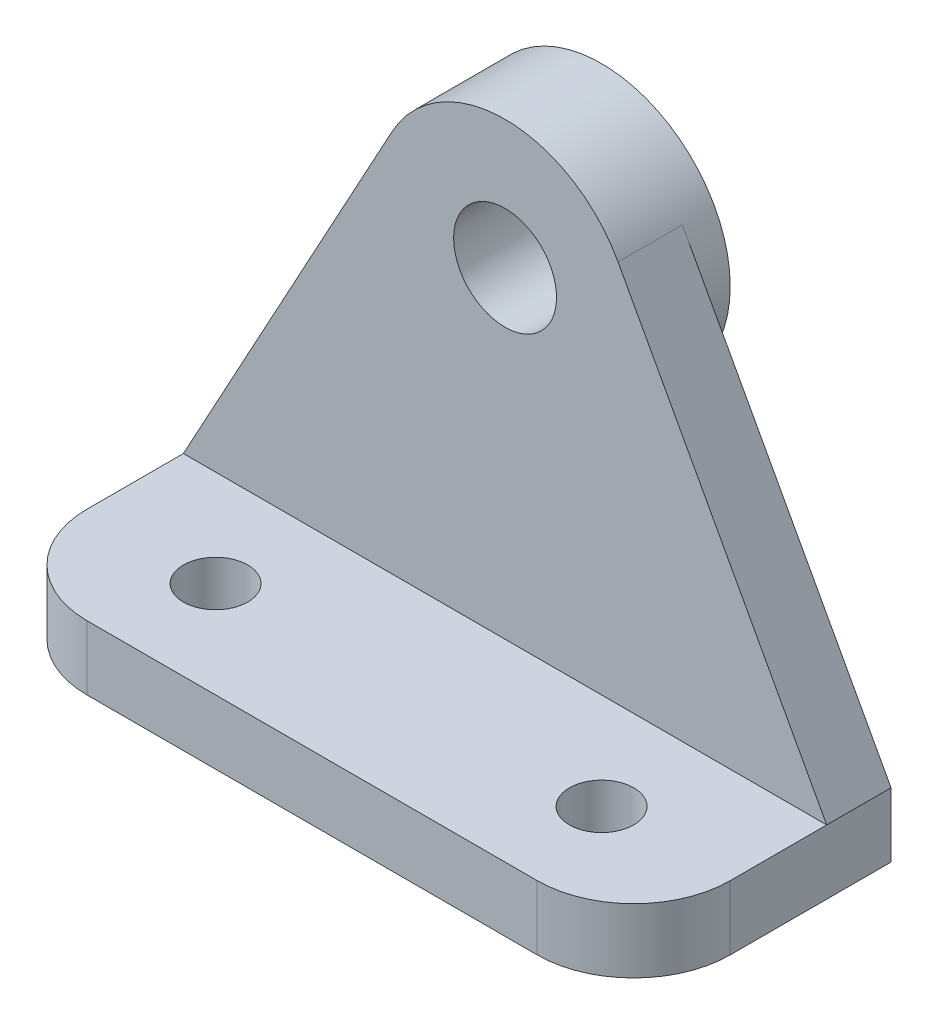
from build123d import *

# Parameters (mm, degrees)
SKETCH1_W           = 100
SKETCH1_H           = 40
BOSS_EXTRUDE1_DEPTH = 10
BOSS_EXTRUDE2_DEPTH = 10
BOSS_EXTRUDE3_START = -15
SKETCH3_R           = 20
BOSS_EXTRUDE3_DEPTH = 15
SKETCH4_R           = 8
CUT_EXTRUDE1_DEPTH  = 105.522724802
SKETCH5_R           = 5
CUT_EXTRUDE2_DEPTH  = 105.522724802
FILLET1_R           = 15


with BuildPart() as part:
    # Sketch1 → Boss-Extrude1 (new body)
    with BuildSketch(Plane(origin=(0, 0, 0), x_dir=(1, 0, 0), z_dir=(0, 1, 0))):
        with Locations((0, 20)):
            Rectangle(SKETCH1_W, SKETCH1_H)
    extrude(amount=BOSS_EXTRUDE1_DEPTH)

    # Sketch2 → Boss-Extrude2 (add)
    with BuildSketch(Plane(origin=(0, 0, -40), x_dir=(-1, 0, 0), z_dir=(0, 0, -1))):
        with BuildLine():
            Line((-50, 10), (50, 10))
            Line((50, 10), (17.564659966, 69.564659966))
            ThreePointArc((17.564659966, 69.564659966), (0, 80), (-17.564659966, 69.564659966))
            Line((-17.564659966, 69.564659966), (-50, 10))
        make_face()
    extrude(amount=-BOSS_EXTRUDE2_DEPTH)

    # Sketch3 → Boss-Extrude3 (add)
    with BuildSketch(Plane.XY.offset(-30).offset(BOSS_EXTRUDE3_START)):
        with Locations(Location((0, 60, 0), (0, 0, 151.429940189))):
            Circle(SKETCH3_R)
    extrude(amount=BOSS_EXTRUDE3_DEPTH)

    # Sketch4 → Cut-Extrude1 (cut, through all)
    with BuildSketch(Plane(origin=(0, 0, -45), x_dir=(-1, 0, 0), z_dir=(0, 0, -1))):
        with Locations((0, 60)):
            Circle(SKETCH4_R)
    extrude(amount=-CUT_EXTRUDE1_DEPTH, mode=Mode.SUBTRACT)

    # Sketch5 → Cut-Extrude2 (cut, through all)
    with BuildSketch(Plane.XZ):
        with Locations(Location((-30, -15, 0), (0, 0, 270))):
            Circle(SKETCH5_R)
    cut_extrude2 = extrude(amount=-CUT_EXTRUDE2_DEPTH, mode=Mode.SUBTRACT)

    # Mirror1: Cut-Extrude2 across plane
    add(cut_extrude2.mirror(Plane(origin=(0, 0, 0), x_dir=(0, 0, 1), z_dir=(1, 0, 0))), mode=Mode.SUBTRACT)

    # Fillet1
    fillet1_edges = [part.edges().sort_by_distance(p)[0] for p in [
        (50, 5, 0),
        (-50, 5, 0),
    ]]
    fillet(fillet1_edges, radius=FILLET1_R)


solid = part.part
